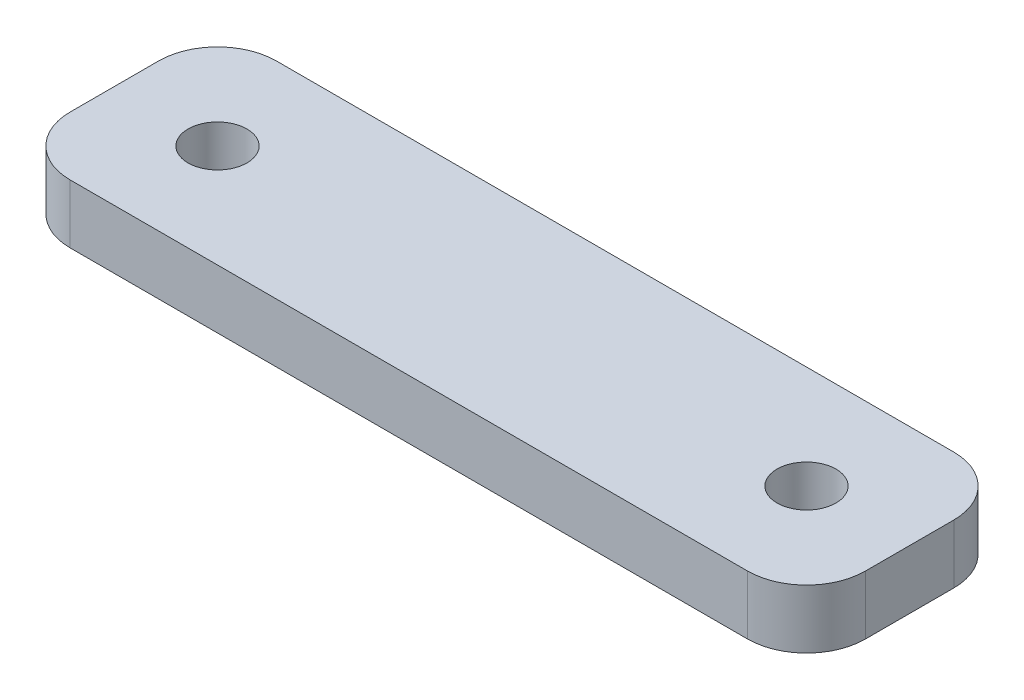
from build123d import *

# Parameters (mm, degrees)
SKETCH1_W           = 34.29
SKETCH1_H           = 8.89
BOSS_EXTRUDE1_DEPTH = 2.54
SKETCH4_R           = 1.27
CUT_EXTRUDE3_DEPTH  = 18.893033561
FILLET1_R           = 2.54


with BuildPart() as part:
    # Sketch1 → Boss-Extrude1 (new body)
    with BuildSketch(Plane(origin=(0, 0, 0), x_dir=(1, 0, 0), z_dir=(0, 1, 0))):
        Rectangle(SKETCH1_W, SKETCH1_H)
    extrude(amount=BOSS_EXTRUDE1_DEPTH)

    # Sketch4 → Cut-Extrude3 (cut, through all)
    with BuildSketch(Plane(origin=(0, 2.54, 0), x_dir=(1, 0, 0), z_dir=(0, 1, 0))):
        with Locations(Location((-12.7, 0, 0), (0, 0, 270))):
            Circle(SKETCH4_R)
        with Locations(Location((12.7, 0, 0), (0, 0, 90))):
            Circle(SKETCH4_R)
    extrude(amount=-CUT_EXTRUDE3_DEPTH, mode=Mode.SUBTRACT)

    # Fillet1
    fillet1_edges = [part.edges().sort_by_distance(p)[0] for p in [
        (-17.145, 1.27, -4.445),
        (17.145, 1.27, -4.445),
        (17.145, 1.27, 4.445),
        (-17.145, 1.27, 4.445),
    ]]
    fillet(fillet1_edges, radius=FILLET1_R)


solid = part.part
